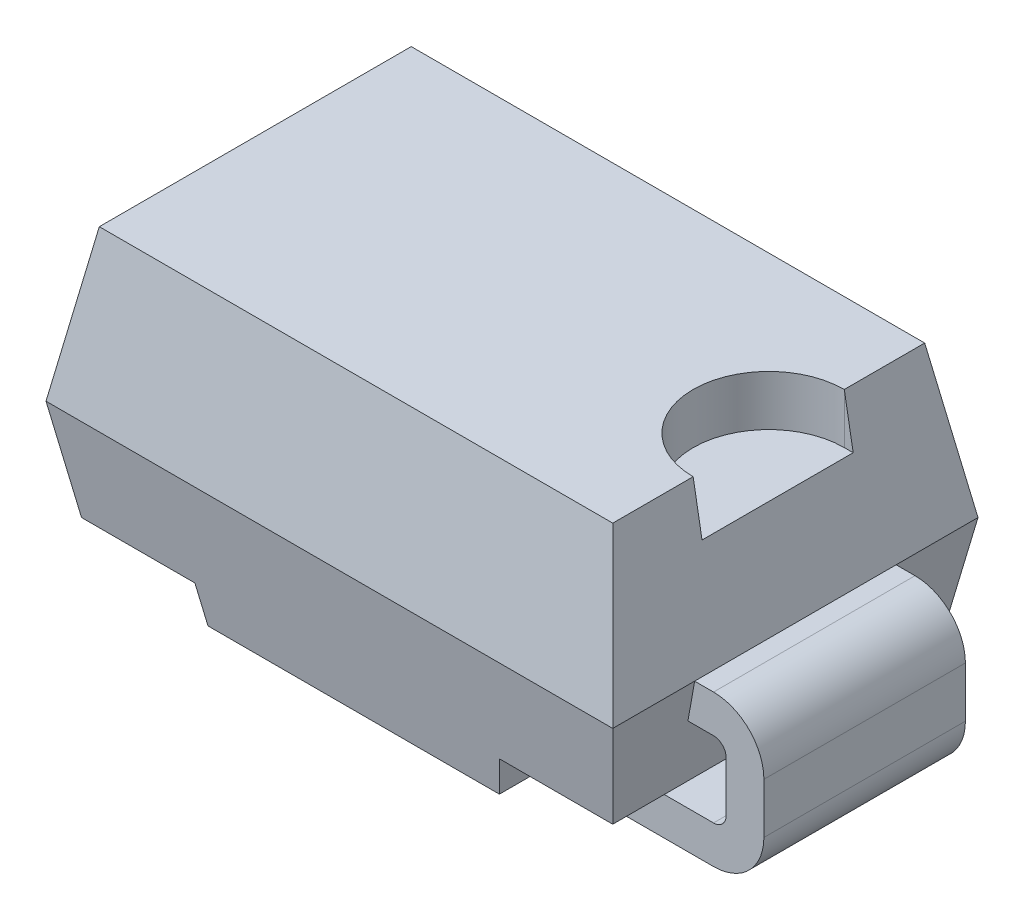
from build123d import *

# Parameters (mm, degrees)
EXTRUDE_START            = -0.8
EXTRUDE_1_DEPTH          = 1.6
EXTRUDE_3_DEPTH          = 1.45
CUT_EXTRUDE_1_DEPTH      = 4.96263801
CUT_EXTRUDE_1_DEPTH_BACK = 4.96263801
SKETCH_4_OUTSIDE_W       = 6.25
SKETCH_4_OUTSIDE_H       = 5.75
CUT_EXTRUDE_2_DEPTH      = 0.4


with BuildPart() as part:
    # Sketch 1 → Extrude 1 (new body)
    with BuildSketch(Plane.XY.offset(EXTRUDE_START)):
        with BuildLine():
            Line((-1.5, 0.3), (-2.4, 0.3))
            ThreePointArc((-2.4, 0.3), (-2.470710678, 0.329289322), (-2.5, 0.4))
            Line((-2.5, 0.4), (-2.5, 0.8))
            ThreePointArc((-2.5, 0.8), (-2.470710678, 0.870710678), (-2.4, 0.9))
            Line((-2.4, 0.9), (2.4, 0.9))
            ThreePointArc((2.4, 0.9), (2.470710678, 0.870710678), (2.5, 0.8))
            Line((2.5, 0.8), (2.5, 0.4))
            ThreePointArc((2.5, 0.4), (2.470710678, 0.329289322), (2.4, 0.3))
            Line((2.4, 0.3), (1.5, 0.3))
            Line((1.5, 0.3), (1.5, 0))
            Line((1.5, 0), (2.4, 0))
            ThreePointArc((2.4, 0), (2.682842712, 0.117157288), (2.8, 0.4))
            Line((2.8, 0.4), (2.8, 0.8))
            ThreePointArc((2.8, 0.8), (2.682842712, 1.082842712), (2.4, 1.2))
            Line((2.4, 1.2), (-2.4, 1.2))
            ThreePointArc((-2.4, 1.2), (-2.682842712, 1.082842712), (-2.8, 0.8))
            Line((-2.8, 0.8), (-2.8, 0.4))
            ThreePointArc((-2.8, 0.4), (-2.682842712, 0.117157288), (-2.4, 0))
            Line((-2.4, 0), (-1.5, 0))
            Line((-1.5, 0), (-1.5, 0.3))
        make_face()
    extrude(amount=EXTRUDE_1_DEPTH)

    # Sketch 3 → Extrude 3 (add, symmetric)
    with BuildSketch(Plane.XY):
        Polygon((2.038407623, 2.4), (-2.038407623, 2.4), (-2.25, 1.2), (-2.108938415, 0.4), (-1.208938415, 0.4), (-1.156843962, 0.104557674), (1.156843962, 0.104557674), (1.208938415, 0.4), (2.108938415, 0.4), (2.25, 1.2), align=None)
    extrude(amount=EXTRUDE_3_DEPTH, both=True)

    # Sketch 4 outside → Cut-Extrude 1 (cut, two sides: drawn at the far end of the back side and taken through both)
    with BuildSketch(Plane(origin=(0, 0, 0), x_dir=(0, 0, -1), z_dir=(1, 0, 0)).offset(-CUT_EXTRUDE_1_DEPTH_BACK)):
        with Locations((0, 1.2)):
            Rectangle(SKETCH_4_OUTSIDE_W, SKETCH_4_OUTSIDE_H)
        Polygon((1.45, 1.2), (1.238407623, 2.4), (-1.238407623, 2.4), (-1.45, 1.2), (-1.238407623, 0), (1.238407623, 0), align=None, mode=Mode.SUBTRACT)
    extrude(amount=CUT_EXTRUDE_1_DEPTH + CUT_EXTRUDE_1_DEPTH_BACK, mode=Mode.SUBTRACT)

    # Sketch 5 → Cut-Extrude 2 (cut)
    with BuildSketch(Plane(origin=(0, 2.4, 0), x_dir=(-1, 0, 0), z_dir=(0, 1, 0))):
        with BuildLine():
            Line((-2.25, -0.6), (-2.038407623, -0.6))
            ThreePointArc((-2.038407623, -0.6), (-1.438407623, 0), (-2.038407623, 0.6))
            Line((-2.038407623, 0.6), (-2.25, 0.6))
            Line((-2.25, 0.6), (-2.25, -0.6))
        make_face()
    extrude(amount=-CUT_EXTRUDE_2_DEPTH, mode=Mode.SUBTRACT)


solid = part.part
